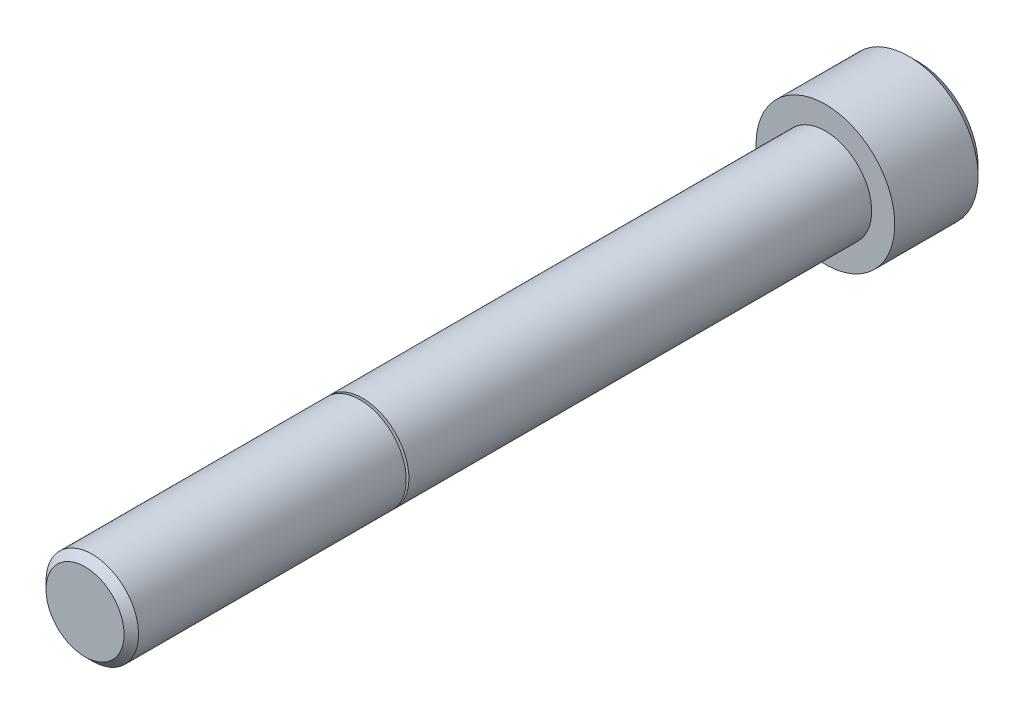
from build123d import *

# Parameters (mm, degrees)
CUT_EXTRUDE1_DEPTH = 6.35


with BuildPart() as part:
    # Logo3_bib1 → Revolve1 (revolve)
    with BuildSketch(Plane(origin=(0, 0, 0), x_dir=(-1, 0, 0), z_dir=(0, -1, 0))):
        with BuildLine():
            Line((0, -101.6), (0, 12.7))
            Line((0, 12.7), (8.255, 12.7))
            Line((8.255, 12.7), (9.525, 11.43))
            Line((9.525, 11.43), (9.525, 0))
            Line((9.525, 0), (6.35, 0))
            Line((6.35, 0), (6.35, -63.51))
            Line((6.35, -63.51), (5.471555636, -63.51))
            ThreePointArc((5.471555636, -63.51), (5.451859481, -63.526527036), (5.464715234, -63.548793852))
            Line((5.464715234, -63.548793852), (6.35, -63.871011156))
            Line((6.35, -63.871011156), (6.35, -100.60813))
            Line((6.35, -100.60813), (5.35813, -101.6))
            Line((5.35813, -101.6), (0, -101.6))
        make_face()
    revolve(axis=Axis((0, 0, -10.585154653), (0, 0, 1)))

    # Logo3_bib2 → Cut-Extrude1 (cut)
    with BuildSketch(Plane(origin=(0, 0, -12.7), x_dir=(1, 0, 0), z_dir=(0, 0, -1))):
        Polygon((5.499261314, 0), (2.749630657, 4.7625), (-2.749630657, 4.7625), (-5.499261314, 0), (-2.749630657, -4.7625), (2.749630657, -4.7625), align=None)
    extrude(amount=-CUT_EXTRUDE1_DEPTH, mode=Mode.SUBTRACT)


solid = part.part
